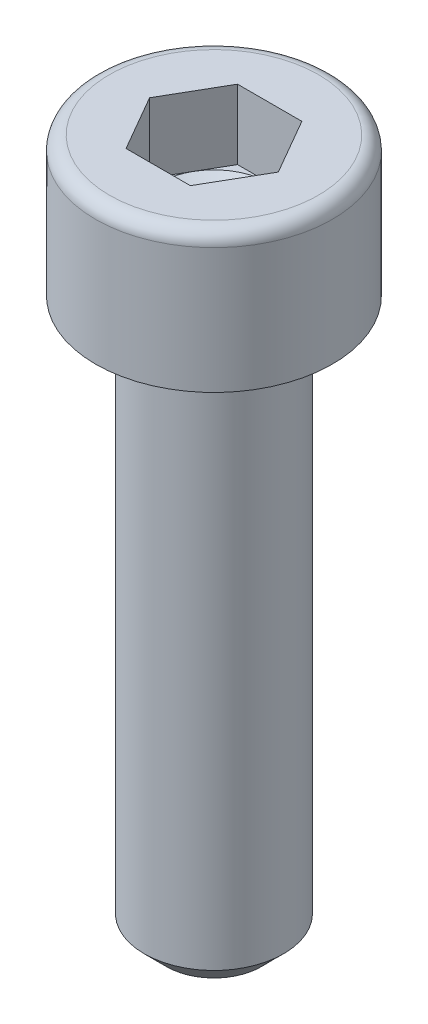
from build123d import *

# Parameters (mm, degrees)
ESQUISSE2_R             = 2.5
TIGE_DEPTH              = 20
CHANFREIN_D_ENTR_E_SIZE = 0.8
HEXAGONE_DEPTH          = 2.5


with BuildPart() as part:
    # Esquisse2 → Tige (new body)
    with BuildSketch(Plane(origin=(0, 0, 0), x_dir=(1, 0, 0), z_dir=(0, 1, 0))):
        with Locations(Location((0, 0, 0), (0, 0, 270))):
            Circle(ESQUISSE2_R)
    extrude(amount=-TIGE_DEPTH)

    # Chanfrein d_entr_e
    chanfrein_d_entr_e_edges = [part.edges().sort_by_distance(p)[0] for p in [
        (0, -20, -2.5),
    ]]
    chamfer(chanfrein_d_entr_e_edges, length=CHANFREIN_D_ENTR_E_SIZE)

    # Esquisse5 → T_te (revolve)
    with BuildSketch(Plane.XY, mode=Mode.PRIVATE) as t_te_sk:
        with BuildLine():
            Line((2, 5), (2, 2.5))
            Line((2, 2.5), (0, 1.345299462))
            Line((0, 1.345299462), (0, 0))
            Line((0, 0), (4.25, 0))
            Line((4.25, 0), (4.25, 4.5))
            ThreePointArc((4.25, 4.5), (4.103553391, 4.853553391), (3.75, 5))
            Line((3.75, 5), (2, 5))
        make_face()
    revolve(t_te_sk.sketch.rotate(Axis((0, 5, 0), (0, -1, 0)), 90), axis=Axis((0, 5, 0), (0, -1, 0)))

    # Esquisse7 → Hexagone (cut)
    with BuildSketch(Plane(origin=(0, 5, 0), x_dir=(-1, 0, 0), z_dir=(0, 1, 0))):
        Polygon((1.154700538, 2), (-1.154700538, 2), (-2.309401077, 0), (-1.154700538, -2), (1.154700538, -2), (2.309401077, 0), align=None)
    extrude(amount=-HEXAGONE_DEPTH, mode=Mode.SUBTRACT)


solid = part.part
